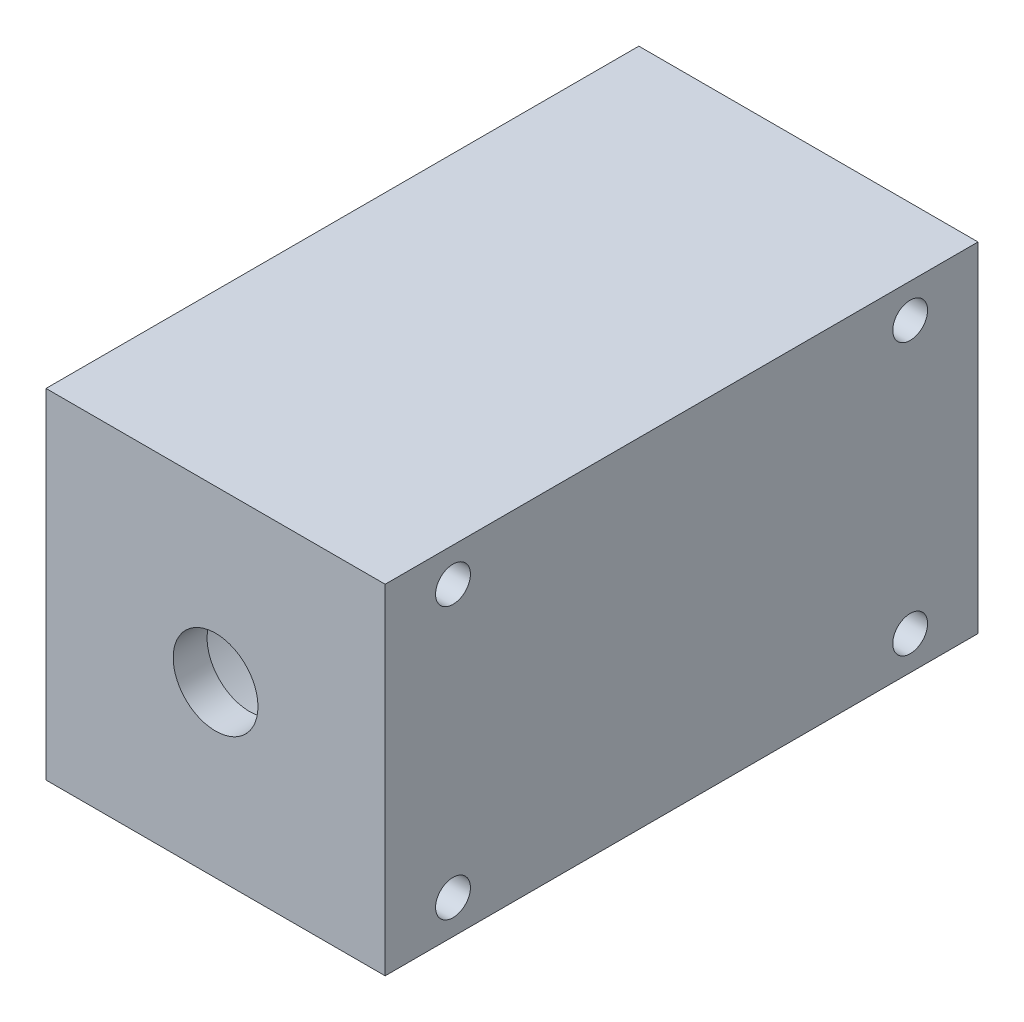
from build123d import *

# Parameters (mm, degrees)
SKETCH1_W                         = 63.5
SKETCH1_H                         = 63.5
EXTRUDE1_DEPTH                    = 110.998
SKETCH2_R                         = 25.4
CUT_EXTRUDE1_DEPTH                = 104.648
SKETCH13_R                        = 25.4
SKETCH13_R_2                      = 7.9375
EXTRUDE2_DEPTH                    = 6.35
F_5_16_18_TAPPED_HOLE3_AT_2_COUNT = 2
F_5_16_18_TAPPED_HOLE3_AT_2_PITCH = 50.8


with BuildPart() as part:
    # Sketch1 → Extrude1 (new body)
    with BuildSketch(Plane.XY):
        with Locations((31.75, 31.75)):
            Rectangle(SKETCH1_W, SKETCH1_H)
    extrude(amount=-EXTRUDE1_DEPTH)

    # Sketch2 → Cut-Extrude1 (cut)
    with BuildSketch(Plane.XY):
        with Locations((31.75, 31.75)):
            Circle(SKETCH2_R)
    extrude(amount=-CUT_EXTRUDE1_DEPTH, mode=Mode.SUBTRACT)

    # Sketch13 → Extrude2 (add)
    with BuildSketch(Plane.XY):
        with Locations((31.75, 31.75)):
            Circle(SKETCH13_R)
        with Locations((31.75, 31.75)):
            Circle(SKETCH13_R_2, mode=Mode.SUBTRACT)
    extrude(amount=-EXTRUDE2_DEPTH)

    # Sketch20 → 5_16-18 Tapped Hole3 (revolve, cut)
    with BuildSketch(Plane(origin=(63.5, 57.15, -12.7), x_dir=(0, 0, -1), z_dir=(0, 1, 0))):
        Polygon((0, 0), (0, 14.661148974), (3.2639, 12.7), (3.2639, 0), align=None)
    f_5_16_18_tapped_hole3 = revolve(axis=Axis((69.85, 57.15, -12.7), (-1, 0, 0)), mode=Mode.SUBTRACT)

    # 5_16-18 Tapped Hole3 at 2: 5_16-18 Tapped Hole3 ×2
    with Locations(*[(0, -i * F_5_16_18_TAPPED_HOLE3_AT_2_PITCH, 0) for i in range(1, F_5_16_18_TAPPED_HOLE3_AT_2_COUNT)]):
        add(f_5_16_18_tapped_hole3, mode=Mode.SUBTRACT)

    # Mirror2: 5_16-18 Tapped Hole3 across plane
    add(f_5_16_18_tapped_hole3.mirror(Plane.XY.offset(-55.499)), mode=Mode.SUBTRACT)

    # Mirror2 copy 1 sketch → Mirror2 copy 1 (revolve, cut)
    with BuildSketch(Plane(origin=(63.5, 6.35, -98.298), x_dir=(0, 0, 1), z_dir=(0, 1, 0))):
        Polygon((0, 0), (0, -14.661148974), (3.2639, -12.7), (3.2639, 0), align=None)
    revolve(axis=Axis((69.85, 6.35, -98.298), (1, 0, 0)), mode=Mode.SUBTRACT)


solid = part.part
